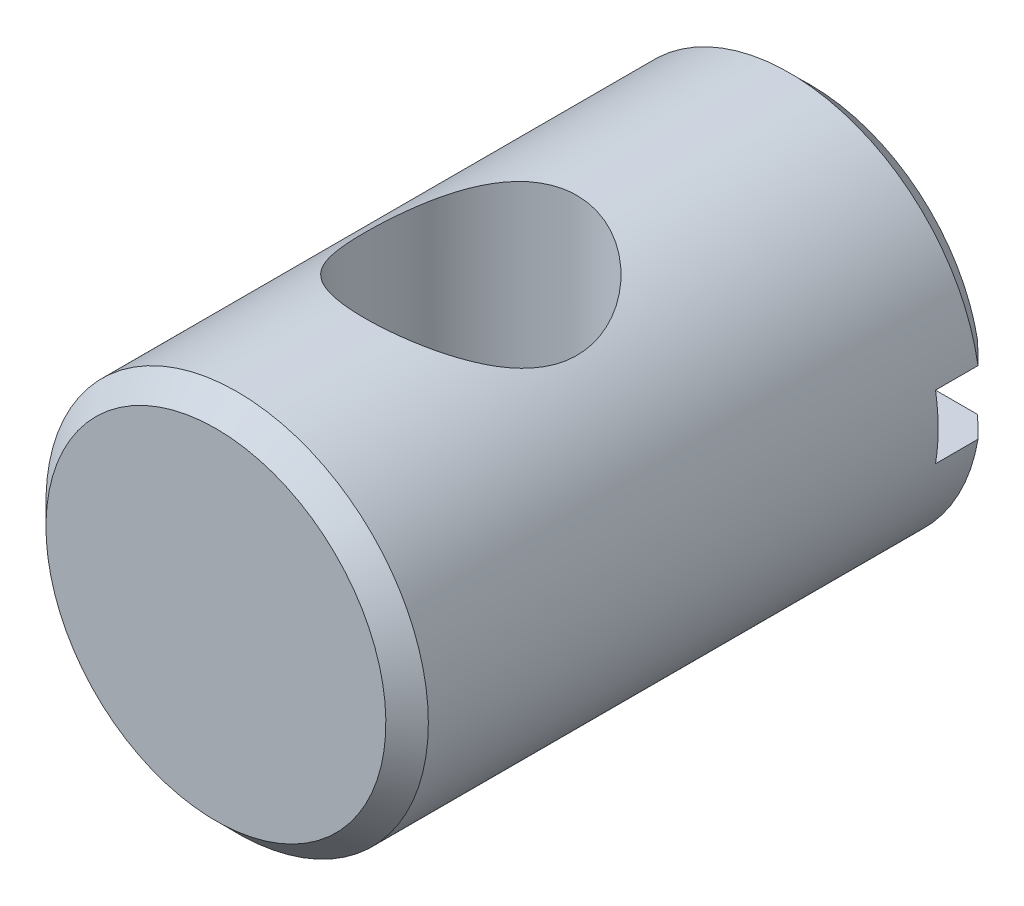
ISO-10303-21;
HEADER;
FILE_DESCRIPTION(('STEP AP214'),'2;1');
FILE_NAME('part.step','',(''),(''),'','','');
FILE_SCHEMA(('AUTOMOTIVE_DESIGN { 1 0 10303 214 1 1 1 1 }'));
ENDSEC;
DATA;
#1=APPLICATION_CONTEXT('core data for automotive mechanical design processes');
#2=APPLICATION_PROTOCOL_DEFINITION('international standard','automotive_design',2000,#1);
#3=PRODUCT_CONTEXT('',#1,'mechanical');
#4=PRODUCT('Part','Part','',(#3));
#5=PRODUCT_RELATED_PRODUCT_CATEGORY('part','',(#4));
#6=PRODUCT_DEFINITION_FORMATION('','',#4);
#7=PRODUCT_DEFINITION_CONTEXT('part definition',#1,'design');
#8=PRODUCT_DEFINITION('design','',#6,#7);
#9=PRODUCT_DEFINITION_SHAPE('','',#8);
#10=(LENGTH_UNIT() NAMED_UNIT(*) SI_UNIT(.MILLI.,.METRE.));
#11=(NAMED_UNIT(*) PLANE_ANGLE_UNIT() SI_UNIT($,.RADIAN.));
#12=(NAMED_UNIT(*) SI_UNIT($,.STERADIAN.) SOLID_ANGLE_UNIT());
#13=UNCERTAINTY_MEASURE_WITH_UNIT(LENGTH_MEASURE(1.E-05),#10,'distance_accuracy_value','');
#14=(GEOMETRIC_REPRESENTATION_CONTEXT(3) GLOBAL_UNCERTAINTY_ASSIGNED_CONTEXT((#13)) GLOBAL_UNIT_ASSIGNED_CONTEXT((#10,
#11,#12)) REPRESENTATION_CONTEXT('',''));
#15=CARTESIAN_POINT('',(0.,0.,0.));
#16=DIRECTION('',(0.,0.,1.));
#17=DIRECTION('',(1.,0.,0.));
#18=AXIS2_PLACEMENT_3D('',#15,#16,#17);
#19=CARTESIAN_POINT('',(-2.42861286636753E-13,0.,-6.49999999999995));
#20=DIRECTION('',(0.,0.,-1.));
#21=DIRECTION('',(-1.,0.,0.));
#22=AXIS2_PLACEMENT_3D('',#19,#20,#21);
#23=PLANE('',#22);
#24=DIRECTION('',(1.,0.,0.));
#25=VECTOR('',#24,1.);
#26=CARTESIAN_POINT('',(5.79284784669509,0.750000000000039,-6.49999999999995));
#27=LINE('',#26,#25);
#28=CARTESIAN_POINT('',(-4.43705983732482,0.750000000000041,-6.49999999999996));
#29=VERTEX_POINT('',#28);
#30=CARTESIAN_POINT('',(4.43705983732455,0.750000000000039,-6.49999999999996));
#31=VERTEX_POINT('',#30);
#32=EDGE_CURVE('E69',#29,#31,#27,.T.);
#33=ORIENTED_EDGE('',*,*,#32,.T.);
#34=CARTESIAN_POINT('',(-1.07087942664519E-13,1.60000569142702E-13,-6.49999999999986));
#35=DIRECTION('',(0.,0.,1.));
#36=DIRECTION('',(1.,0.,0.));
#37=AXIS2_PLACEMENT_3D('',#34,#35,#36);
#38=CIRCLE('',#37,4.5);
#39=CARTESIAN_POINT('',(4.43705983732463,-0.749999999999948,-6.49999999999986));
#40=VERTEX_POINT('',#39);
#41=EDGE_CURVE('E76',#31,#40,#38,.F.);
#42=ORIENTED_EDGE('',*,*,#41,.T.);
#43=DIRECTION('',(1.,0.,0.));
#44=VECTOR('',#43,1.);
#45=CARTESIAN_POINT('',(5.79284784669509,-0.749999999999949,-6.49999999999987));
#46=LINE('',#45,#44);
#47=CARTESIAN_POINT('',(-4.43705983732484,-0.749999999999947,-6.49999999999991));
#48=VERTEX_POINT('',#47);
#49=EDGE_CURVE('E72',#40,#48,#46,.F.);
#50=ORIENTED_EDGE('',*,*,#49,.T.);
#51=CARTESIAN_POINT('',(-1.07087942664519E-13,1.60000569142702E-13,-6.49999999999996));
#52=DIRECTION('',(0.,0.,1.));
#53=DIRECTION('',(1.,0.,0.));
#54=AXIS2_PLACEMENT_3D('',#51,#52,#53);
#55=CIRCLE('',#54,4.5);
#56=EDGE_CURVE('E20',#48,#29,#55,.F.);
#57=ORIENTED_EDGE('',*,*,#56,.T.);
#58=EDGE_LOOP('',(#33,#42,#50,#57));
#59=FACE_BOUND('',#58,.T.);
#60=ADVANCED_FACE('F17',(#59),#23,.T.);
#61=CARTESIAN_POINT('',(5.79284784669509,0.750000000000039,-6.49999999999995));
#62=DIRECTION('',(0.,1.,0.));
#63=DIRECTION('',(0.,0.,1.));
#64=AXIS2_PLACEMENT_3D('',#61,#62,#63);
#65=PLANE('',#64);
#66=CARTESIAN_POINT('',(-3.92905841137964,0.750000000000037,-7.99999999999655));
#67=CARTESIAN_POINT('',(-4.01380437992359,0.750000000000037,-7.91674699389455));
#68=CARTESIAN_POINT('',(-4.0985108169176,0.750000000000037,-7.83345382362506));
#69=CARTESIAN_POINT('',(-4.26784462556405,0.750000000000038,-7.66678715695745));
#70=CARTESIAN_POINT('',(-4.35247199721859,0.750000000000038,-7.58341366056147));
#71=CARTESIAN_POINT('',(-4.43705983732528,0.750000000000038,-7.50000000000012));
#72=B_SPLINE_CURVE_WITH_KNOTS('',3,(#66,#67,#68,#69,#70,#71),.UNSPECIFIED.,.F.,.F.,(4,2,4),(0.,
0.356393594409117,0.712787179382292),.UNSPECIFIED.);
#73=CARTESIAN_POINT('',(-3.92905841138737,0.750000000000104,-7.99999999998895));
#74=VERTEX_POINT('',#73);
#75=CARTESIAN_POINT('',(-4.43705983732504,0.750000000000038,-7.50000000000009));
#76=VERTEX_POINT('',#75);
#77=EDGE_CURVE('E85',#74,#76,#72,.T.);
#78=ORIENTED_EDGE('',*,*,#77,.F.);
#79=DIRECTION('',(1.,0.,0.));
#80=VECTOR('',#79,1.);
#81=CARTESIAN_POINT('',(-1.11022302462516E-13,0.750000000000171,-8.00000000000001));
#82=LINE('',#81,#80);
#83=CARTESIAN_POINT('',(3.92905841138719,0.750000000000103,-7.9999999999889));
#84=VERTEX_POINT('',#83);
#85=EDGE_CURVE('E259',#74,#84,#82,.T.);
#86=ORIENTED_EDGE('',*,*,#85,.T.);
#87=CARTESIAN_POINT('',(4.43705983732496,0.750000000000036,-7.50000000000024));
#88=CARTESIAN_POINT('',(4.3524719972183,0.750000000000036,-7.58341366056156));
#89=CARTESIAN_POINT('',(4.26784462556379,0.750000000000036,-7.66678715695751));
#90=CARTESIAN_POINT('',(4.0985108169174,0.750000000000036,-7.83345382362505));
#91=CARTESIAN_POINT('',(4.01380437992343,0.750000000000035,-7.91674699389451));
#92=CARTESIAN_POINT('',(3.92905841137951,0.750000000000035,-7.99999999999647));
#93=B_SPLINE_CURVE_WITH_KNOTS('',3,(#87,#88,#89,#90,#91,#92),.UNSPECIFIED.,.F.,.F.,(4,2,4),(0.,
0.356393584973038,0.712787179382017),.UNSPECIFIED.);
#94=CARTESIAN_POINT('',(4.43705983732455,0.750000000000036,-7.50000000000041));
#95=VERTEX_POINT('',#94);
#96=EDGE_CURVE('E91',#95,#84,#93,.T.);
#97=ORIENTED_EDGE('',*,*,#96,.F.);
#98=DIRECTION('',(0.,0.,1.));
#99=VECTOR('',#98,1.);
#100=CARTESIAN_POINT('',(4.43705983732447,0.750000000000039,-6.49999999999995));
#101=LINE('',#100,#99);
#102=EDGE_CURVE('E89',#31,#95,#101,.F.);
#103=ORIENTED_EDGE('',*,*,#102,.F.);
#104=ORIENTED_EDGE('',*,*,#32,.F.);
#105=DIRECTION('',(0.,0.,1.));
#106=VECTOR('',#105,1.);
#107=CARTESIAN_POINT('',(-4.43705983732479,0.750000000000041,-6.49999999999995));
#108=LINE('',#107,#106);
#109=EDGE_CURVE('E79',#76,#29,#108,.T.);
#110=ORIENTED_EDGE('',*,*,#109,.F.);
#111=EDGE_LOOP('',(#78,#86,#97,#103,#104,#110));
#112=FACE_BOUND('',#111,.T.);
#113=ADVANCED_FACE('F87',(#112),#65,.F.);
#114=CARTESIAN_POINT('',(5.79284784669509,-0.749999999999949,-6.49999999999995));
#115=DIRECTION('',(0.,-1.,0.));
#116=DIRECTION('',(0.,0.,-1.));
#117=AXIS2_PLACEMENT_3D('',#114,#115,#116);
#118=PLANE('',#117);
#119=CARTESIAN_POINT('',(3.92905841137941,-0.749999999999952,-7.99999999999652));
#120=CARTESIAN_POINT('',(4.01380437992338,-0.749999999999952,-7.9167469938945));
#121=CARTESIAN_POINT('',(4.0985108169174,-0.749999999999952,-7.833453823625));
#122=CARTESIAN_POINT('',(4.2678446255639,-0.749999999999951,-7.66678715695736));
#123=CARTESIAN_POINT('',(4.35247199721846,-0.749999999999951,-7.58341366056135));
#124=CARTESIAN_POINT('',(4.43705983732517,-0.749999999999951,-7.49999999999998));
#125=B_SPLINE_CURVE_WITH_KNOTS('',3,(#119,#120,#121,#122,#123,#124),.UNSPECIFIED.,.F.,.F.,(4,2,
4),(0.,0.356393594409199,0.712787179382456),.UNSPECIFIED.);
#126=CARTESIAN_POINT('',(3.92905841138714,-0.749999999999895,-7.99999999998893));
#127=VERTEX_POINT('',#126);
#128=CARTESIAN_POINT('',(4.43705983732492,-0.749999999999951,-7.50000000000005));
#129=VERTEX_POINT('',#128);
#130=EDGE_CURVE('E139',#127,#129,#125,.T.);
#131=ORIENTED_EDGE('',*,*,#130,.F.);
#132=DIRECTION('',(1.,0.,0.));
#133=VECTOR('',#132,1.);
#134=CARTESIAN_POINT('',(-1.11022302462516E-13,-0.749999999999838,-8.00000000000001));
#135=LINE('',#134,#133);
#136=CARTESIAN_POINT('',(-3.9290584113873,-0.749999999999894,-7.99999999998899));
#137=VERTEX_POINT('',#136);
#138=EDGE_CURVE('E138',#127,#137,#135,.F.);
#139=ORIENTED_EDGE('',*,*,#138,.T.);
#140=CARTESIAN_POINT('',(-4.4370598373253,-0.749999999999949,-7.50000000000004));
#141=CARTESIAN_POINT('',(-4.35247199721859,-0.74999999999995,-7.58341366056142));
#142=CARTESIAN_POINT('',(-4.26784462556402,-0.74999999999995,-7.66678715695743));
#143=CARTESIAN_POINT('',(-4.09851081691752,-0.74999999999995,-7.83345382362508));
#144=CARTESIAN_POINT('',(-4.01380437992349,-0.749999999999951,-7.91674699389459));
#145=CARTESIAN_POINT('',(-3.92905841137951,-0.749999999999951,-7.99999999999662));
#146=B_SPLINE_CURVE_WITH_KNOTS('',3,(#140,#141,#142,#143,#144,#145),.UNSPECIFIED.,.F.,.F.,(4,2,
4),(0.,0.35639358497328,0.712787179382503),.UNSPECIFIED.);
#147=CARTESIAN_POINT('',(-4.43705983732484,-0.749999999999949,-7.50000000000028));
#148=VERTEX_POINT('',#147);
#149=EDGE_CURVE('E35',#148,#137,#146,.T.);
#150=ORIENTED_EDGE('',*,*,#149,.F.);
#151=DIRECTION('',(0.,0.,-1.));
#152=VECTOR('',#151,1.);
#153=CARTESIAN_POINT('',(-4.43705983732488,-0.749999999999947,-6.49999999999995));
#154=LINE('',#153,#152);
#155=EDGE_CURVE('E263',#48,#148,#154,.T.);
#156=ORIENTED_EDGE('',*,*,#155,.F.);
#157=ORIENTED_EDGE('',*,*,#49,.F.);
#158=DIRECTION('',(0.,0.,-1.));
#159=VECTOR('',#158,1.);
#160=CARTESIAN_POINT('',(4.43705983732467,-0.749999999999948,-6.49999999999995));
#161=LINE('',#160,#159);
#162=EDGE_CURVE('E147',#129,#40,#161,.F.);
#163=ORIENTED_EDGE('',*,*,#162,.F.);
#164=EDGE_LOOP('',(#131,#139,#150,#156,#157,#163));
#165=FACE_BOUND('',#164,.T.);
#166=ADVANCED_FACE('F152',(#165),#118,.F.);
#167=CARTESIAN_POINT('',(-1.11022302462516E-13,1.56125112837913E-13,-8.00000000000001));
#168=DIRECTION('',(0.,0.,1.));
#169=DIRECTION('',(1.,0.,0.));
#170=AXIS2_PLACEMENT_3D('',#167,#168,#169);
#171=PLANE('',#170);
#172=ORIENTED_EDGE('',*,*,#85,.F.);
#173=CARTESIAN_POINT('',(-1.12323345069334E-13,1.79158385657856E-13,-7.99999999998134));
#174=DIRECTION('',(0.,0.,1.));
#175=DIRECTION('',(1.,0.,0.));
#176=AXIS2_PLACEMENT_3D('',#173,#174,#175);
#177=CIRCLE('',#176,4.00000000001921);
#178=EDGE_CURVE('E135',#84,#74,#177,.T.);
#179=ORIENTED_EDGE('',*,*,#178,.F.);
#180=EDGE_LOOP('',(#172,#179));
#181=FACE_BOUND('',#180,.T.);
#182=ADVANCED_FACE('F184',(#181),#171,.F.);
#183=CARTESIAN_POINT('',(-1.11022302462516E-13,1.56125112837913E-13,-8.00000000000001));
#184=DIRECTION('',(0.,0.,1.));
#185=DIRECTION('',(1.,0.,0.));
#186=AXIS2_PLACEMENT_3D('',#183,#184,#185);
#187=PLANE('',#186);
#188=ORIENTED_EDGE('',*,*,#138,.F.);
#189=CARTESIAN_POINT('',(-1.12323345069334E-13,1.79158385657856E-13,-7.99999999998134));
#190=DIRECTION('',(0.,0.,1.));
#191=DIRECTION('',(1.,0.,0.));
#192=AXIS2_PLACEMENT_3D('',#189,#190,#191);
#193=CIRCLE('',#192,4.00000000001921);
#194=EDGE_CURVE('E131',#137,#127,#193,.T.);
#195=ORIENTED_EDGE('',*,*,#194,.F.);
#196=EDGE_LOOP('',(#188,#195));
#197=FACE_BOUND('',#196,.T.);
#198=ADVANCED_FACE('F167',(#197),#187,.F.);
#199=CARTESIAN_POINT('',(-1.11022302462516E-13,1.80411241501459E-13,-7.50000000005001));
#200=DIRECTION('',(0.,0.,1.));
#201=DIRECTION('',(1.,0.,0.));
#202=AXIS2_PLACEMENT_3D('',#199,#200,#201);
#203=CONICAL_SURFACE('',#202,4.49999999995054,0.785398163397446);
#204=ORIENTED_EDGE('',*,*,#96,.T.);
#205=ORIENTED_EDGE('',*,*,#178,.T.);
#206=ORIENTED_EDGE('',*,*,#77,.T.);
#207=CARTESIAN_POINT('',(-1.09710849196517E-13,1.57416931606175E-13,-7.50000000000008));
#208=DIRECTION('',(0.,0.,1.));
#209=DIRECTION('',(1.,0.,0.));
#210=AXIS2_PLACEMENT_3D('',#207,#208,#209);
#211=CIRCLE('',#210,4.5);
#212=EDGE_CURVE('E83',#95,#76,#211,.T.);
#213=ORIENTED_EDGE('',*,*,#212,.F.);
#214=EDGE_LOOP('',(#204,#205,#206,#213));
#215=FACE_BOUND('',#214,.T.);
#216=ADVANCED_FACE('F162',(#215),#203,.T.);
#217=CARTESIAN_POINT('',(-1.66533453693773E-13,2.1163626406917E-13,5.99999999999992));
#218=DIRECTION('',(0.,0.,1.));
#219=DIRECTION('',(1.,0.,0.));
#220=AXIS2_PLACEMENT_3D('',#217,#218,#219);
#221=PLANE('',#220);
#222=CARTESIAN_POINT('',(-1.66581640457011E-13,2.11693674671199E-13,6.00000000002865));
#223=DIRECTION('',(0.,0.,-1.));
#224=DIRECTION('',(0.,1.,0.));
#225=AXIS2_PLACEMENT_3D('',#222,#223,#224);
#226=CIRCLE('',#225,3.99999999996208);
#227=CARTESIAN_POINT('',(-1.66581640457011E-13,3.99999999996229,6.00000000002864));
#228=VERTEX_POINT('',#227);
#229=EDGE_CURVE('E125',#228,#228,#226,.T.);
#230=ORIENTED_EDGE('',*,*,#229,.F.);
#231=EDGE_LOOP('',(#230));
#232=FACE_BOUND('',#231,.T.);
#233=ADVANCED_FACE('F158',(#232),#221,.T.);
#234=CARTESIAN_POINT('',(-1.11022302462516E-13,1.80411241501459E-13,-7.50000000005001));
#235=DIRECTION('',(0.,0.,1.));
#236=DIRECTION('',(1.,0.,0.));
#237=AXIS2_PLACEMENT_3D('',#234,#235,#236);
#238=CONICAL_SURFACE('',#237,4.49999999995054,0.785398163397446);
#239=ORIENTED_EDGE('',*,*,#149,.T.);
#240=ORIENTED_EDGE('',*,*,#194,.T.);
#241=ORIENTED_EDGE('',*,*,#130,.T.);
#242=CARTESIAN_POINT('',(-1.09710849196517E-13,1.57416931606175E-13,-7.5000000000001));
#243=DIRECTION('',(0.,0.,1.));
#244=DIRECTION('',(1.,0.,0.));
#245=AXIS2_PLACEMENT_3D('',#242,#243,#244);
#246=CIRCLE('',#245,4.5);
#247=EDGE_CURVE('E124',#148,#129,#246,.T.);
#248=ORIENTED_EDGE('',*,*,#247,.F.);
#249=EDGE_LOOP('',(#239,#240,#241,#248));
#250=FACE_BOUND('',#249,.T.);
#251=ADVANCED_FACE('F117',(#250),#238,.T.);
#252=CARTESIAN_POINT('',(-1.67834496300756E-13,2.10344445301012E-13,5.50000000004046));
#253=DIRECTION('',(0.,0.,-1.));
#254=DIRECTION('',(0.,1.,0.));
#255=AXIS2_PLACEMENT_3D('',#252,#253,#254);
#256=CONICAL_SURFACE('',#255,4.49999999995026,0.785398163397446);
#257=CARTESIAN_POINT('',(0.,1.91004219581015E-13,5.5));
#258=DIRECTION('',(0.,0.,1.));
#259=DIRECTION('',(1.,0.,0.));
#260=AXIS2_PLACEMENT_3D('',#257,#258,#259);
#261=CIRCLE('',#260,4.5);
#262=CARTESIAN_POINT('',(4.49999999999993,1.91004219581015E-13,5.49999999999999));
#263=VERTEX_POINT('',#262);
#264=EDGE_CURVE('E26',#263,#263,#261,.F.);
#265=ORIENTED_EDGE('',*,*,#264,.F.);
#266=EDGE_LOOP('',(#265));
#267=FACE_BOUND('',#266,.T.);
#268=ORIENTED_EDGE('',*,*,#229,.T.);
#269=EDGE_LOOP('',(#268));
#270=FACE_BOUND('',#269,.T.);
#271=ADVANCED_FACE('F112',(#267,#270),#256,.T.);
#272=CARTESIAN_POINT('',(0.,4.50000000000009,0.));
#273=DIRECTION('',(0.,1.,0.));
#274=DIRECTION('',(0.,0.,1.));
#275=AXIS2_PLACEMENT_3D('',#272,#273,#274);
#276=CYLINDRICAL_SURFACE('',#275,2.49999999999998);
#277=CARTESIAN_POINT('',(0.,-4.49999999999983,-2.50000000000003));
#278=CARTESIAN_POINT('',(-0.129752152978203,-4.50000234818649,-2.50000277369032));
#279=CARTESIAN_POINT('',(-0.259488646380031,-4.49433973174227,-2.48985362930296));
#280=CARTESIAN_POINT('',(-0.514931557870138,-4.4722802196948,-2.44980965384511));
#281=CARTESIAN_POINT('',(-0.640637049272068,-4.45588087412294,-2.419910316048));
#282=CARTESIAN_POINT('',(-0.884087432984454,-4.41402415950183,-2.34193967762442));
#283=CARTESIAN_POINT('',(-1.00185985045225,-4.38860025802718,-2.29393547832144));
#284=CARTESIAN_POINT('',(-1.2274603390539,-4.33092561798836,-2.18156801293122));
#285=CARTESIAN_POINT('',(-1.33528606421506,-4.2986732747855,-2.11720090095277));
#286=CARTESIAN_POINT('',(-1.54633614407,-4.22753980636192,-1.96891330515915));
#287=CARTESIAN_POINT('',(-1.648719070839,-4.18835367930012,-1.88394433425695));
#288=CARTESIAN_POINT('',(-1.83858804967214,-4.10855472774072,-1.69916731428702));
#289=CARTESIAN_POINT('',(-1.92605889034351,-4.06794049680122,-1.59934430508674));
#290=CARTESIAN_POINT('',(-2.09257062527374,-3.98505246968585,-1.37568480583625));
#291=CARTESIAN_POINT('',(-2.16985879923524,-3.94302762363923,-1.25043993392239));
#292=CARTESIAN_POINT('',(-2.30193681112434,-3.86741691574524,-0.986308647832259));
#293=CARTESIAN_POINT('',(-2.35675885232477,-3.83381900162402,-0.847442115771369));
#294=CARTESIAN_POINT('',(-2.43228219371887,-3.7862330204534,-0.589942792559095));
#295=CARTESIAN_POINT('',(-2.45773277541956,-3.76960777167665,-0.473190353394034));
#296=CARTESIAN_POINT('',(-2.49167870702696,-3.74726165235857,-0.236264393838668));
#297=CARTESIAN_POINT('',(-2.50019076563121,-3.74153003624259,-0.116094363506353));
#298=CARTESIAN_POINT('',(-2.49980245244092,-3.74178926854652,0.124331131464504));
#299=CARTESIAN_POINT('',(-2.49088301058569,-3.74779295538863,0.24458654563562));
#300=CARTESIAN_POINT('',(-2.45610446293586,-3.77067197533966,0.481578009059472));
#301=CARTESIAN_POINT('',(-2.43023435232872,-3.78755437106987,0.598311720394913));
#302=CARTESIAN_POINT('',(-2.36277648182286,-3.82999425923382,0.825432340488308));
#303=CARTESIAN_POINT('',(-2.32118520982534,-3.85555368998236,0.935817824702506));
#304=CARTESIAN_POINT('',(-2.22370246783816,-3.91258611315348,1.14840769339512));
#305=CARTESIAN_POINT('',(-2.16780543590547,-3.94406140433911,1.25060887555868));
#306=CARTESIAN_POINT('',(-2.03346523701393,-4.01517451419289,1.46041196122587));
#307=CARTESIAN_POINT('',(-1.95288676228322,-4.05532589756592,1.56647471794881));
#308=CARTESIAN_POINT('',(-1.77597038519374,-4.13586598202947,1.76453479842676));
#309=CARTESIAN_POINT('',(-1.67961967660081,-4.17625485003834,1.85652057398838));
#310=CARTESIAN_POINT('',(-1.46212999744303,-4.25757767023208,2.03315666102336));
#311=CARTESIAN_POINT('',(-1.33946785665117,-4.29815115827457,2.11611580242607));
#312=CARTESIAN_POINT('',(-1.07945230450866,-4.37069105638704,2.25982127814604));
#313=CARTESIAN_POINT('',(-0.942111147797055,-4.40266456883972,2.32058595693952));
#314=CARTESIAN_POINT('',(-0.672038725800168,-4.4514171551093,2.41172680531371));
#315=CARTESIAN_POINT('',(-0.540407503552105,-4.4694629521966,2.44467338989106));
#316=CARTESIAN_POINT('',(-0.272509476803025,-4.49374886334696,2.48880064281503));
#317=CARTESIAN_POINT('',(-0.136246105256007,-4.49999753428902,2.4999970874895));
#318=CARTESIAN_POINT('',(0.129752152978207,-4.50000234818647,2.50000277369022));
#319=CARTESIAN_POINT('',(0.259488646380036,-4.49433973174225,2.48985362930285));
#320=CARTESIAN_POINT('',(0.514931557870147,-4.47228021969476,2.44980965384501));
#321=CARTESIAN_POINT('',(0.640637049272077,-4.4558808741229,2.41991031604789));
#322=CARTESIAN_POINT('',(0.884087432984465,-4.41402415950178,2.34193967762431));
#323=CARTESIAN_POINT('',(1.00185985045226,-4.38860025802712,2.29393547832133));
#324=CARTESIAN_POINT('',(1.22746033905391,-4.33092561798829,2.18156801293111));
#325=CARTESIAN_POINT('',(1.33528606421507,-4.29867327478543,2.11720090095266));
#326=CARTESIAN_POINT('',(1.54633614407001,-4.22753980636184,1.96891330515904));
#327=CARTESIAN_POINT('',(1.64871907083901,-4.18835367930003,1.88394433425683));
#328=CARTESIAN_POINT('',(1.83858804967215,-4.10855472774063,1.6991673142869));
#329=CARTESIAN_POINT('',(1.92605889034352,-4.06794049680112,1.59934430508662));
#330=CARTESIAN_POINT('',(2.09257062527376,-3.98505246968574,1.37568480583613));
#331=CARTESIAN_POINT('',(2.16985879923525,-3.94302762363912,1.25043993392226));
#332=CARTESIAN_POINT('',(2.30193681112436,-3.86741691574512,0.986308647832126));
#333=CARTESIAN_POINT('',(2.35675885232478,-3.8338190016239,0.847442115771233));
#334=CARTESIAN_POINT('',(2.43228219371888,-3.78623302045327,0.58994279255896));
#335=CARTESIAN_POINT('',(2.45773277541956,-3.76960777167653,0.473190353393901));
#336=CARTESIAN_POINT('',(2.49167870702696,-3.74726165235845,0.236264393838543));
#337=CARTESIAN_POINT('',(2.50019076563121,-3.74153003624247,0.116094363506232));
#338=CARTESIAN_POINT('',(2.49980245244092,-3.7417892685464,-0.124331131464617));
#339=CARTESIAN_POINT('',(2.49088301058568,-3.74779295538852,-0.244586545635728));
#340=CARTESIAN_POINT('',(2.45610446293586,-3.77067197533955,-0.481578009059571));
#341=CARTESIAN_POINT('',(2.43023435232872,-3.78755437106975,-0.598311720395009));
#342=CARTESIAN_POINT('',(2.36277648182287,-3.82999425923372,-0.825432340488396));
#343=CARTESIAN_POINT('',(2.32118520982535,-3.85555368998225,-0.935817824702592));
#344=CARTESIAN_POINT('',(2.22370246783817,-3.91258611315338,-1.1484076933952));
#345=CARTESIAN_POINT('',(2.16780543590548,-3.94406140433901,-1.25060887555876));
#346=CARTESIAN_POINT('',(2.03346523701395,-4.0151745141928,-1.46041196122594));
#347=CARTESIAN_POINT('',(1.95288676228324,-4.05532589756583,-1.56647471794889));
#348=CARTESIAN_POINT('',(1.77597038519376,-4.13586598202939,-1.76453479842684));
#349=CARTESIAN_POINT('',(1.67961967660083,-4.17625485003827,-1.85652057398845));
#350=CARTESIAN_POINT('',(1.46212999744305,-4.25757767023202,-2.03315666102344));
#351=CARTESIAN_POINT('',(1.3394678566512,-4.29815115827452,-2.11611580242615));
#352=CARTESIAN_POINT('',(1.07945230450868,-4.370691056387,-2.25982127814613));
#353=CARTESIAN_POINT('',(0.942111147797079,-4.40266456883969,-2.32058595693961));
#354=CARTESIAN_POINT('',(0.672038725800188,-4.45141715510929,-2.4117268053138));
#355=CARTESIAN_POINT('',(0.540407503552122,-4.46946295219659,-2.44467338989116));
#356=CARTESIAN_POINT('',(0.272509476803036,-4.49374886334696,-2.48880064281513));
#357=CARTESIAN_POINT('',(0.136246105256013,-4.49999753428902,-2.4999970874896));
#358=CARTESIAN_POINT('',(0.,-4.49999999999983,-2.50000000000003));
#359=B_SPLINE_CURVE_WITH_KNOTS('',3,(#277,#278,#279,#280,#281,#282,#283,#284,#285,#286,#287,
#288,#289,#290,#291,#292,#293,#294,#295,#296,#297,#298,#299,#300,#301,#302,#303,#304,#305,#306,
#307,#308,#309,#310,#311,#312,#313,#314,#315,#316,#317,#318,#319,#320,#321,#322,#323,#324,#325,
#326,#327,#328,#329,#330,#331,#332,#333,#334,#335,#336,#337,#338,#339,#340,#341,#342,#343,#344,
#345,#346,#347,#348,#349,#350,#351,#352,#353,#354,#355,#356,#357,#358),.UNSPECIFIED.,.T.,.F.,(4,
2,2,2,2,2,2,2,2,2,2,2,2,2,2,2,2,2,2,2,2,2,2,2,2,2,2,2,2,2,2,2,2,2,2,2,2,2,2,2,4),(0.,
0.388727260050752,0.777543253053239,1.16493213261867,1.55241214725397,1.96683799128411,
2.3816840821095,2.83857260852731,3.2948039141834,3.6551617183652,4.01516387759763,
4.37556009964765,4.73619053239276,5.09690157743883,5.4577530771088,5.8734371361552,
6.28946039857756,6.74769338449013,7.20554676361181,7.61402579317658,8.0222084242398,
8.41093568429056,8.79975167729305,9.18714055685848,9.57462057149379,9.98904641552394,
10.4038925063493,10.8607810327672,11.3170123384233,11.677370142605,12.0373723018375,
12.3977685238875,12.7583989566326,13.1191100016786,13.4799615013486,13.895645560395,
14.3116688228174,14.7699018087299,15.2277551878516,15.6362342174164,16.0444168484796),.UNSPECIFIED.);
#360=CARTESIAN_POINT('',(0.,-4.49999999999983,-2.50000000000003));
#361=VERTEX_POINT('',#360);
#362=EDGE_CURVE('E11',#361,#361,#359,.T.);
#363=ORIENTED_EDGE('',*,*,#362,.F.);
#364=EDGE_LOOP('',(#363));
#365=FACE_BOUND('',#364,.T.);
#366=CARTESIAN_POINT('',(0.,4.50000000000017,-2.50000000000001));
#367=CARTESIAN_POINT('',(0.129752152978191,4.50000234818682,-2.5000027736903));
#368=CARTESIAN_POINT('',(0.25948864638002,4.4943397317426,-2.48985362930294));
#369=CARTESIAN_POINT('',(0.514931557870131,4.47228021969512,-2.44980965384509));
#370=CARTESIAN_POINT('',(0.640637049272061,4.45588087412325,-2.41991031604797));
#371=CARTESIAN_POINT('',(0.884087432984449,4.41402415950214,-2.3419396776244));
#372=CARTESIAN_POINT('',(1.00185985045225,4.38860025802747,-2.29393547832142));
#373=CARTESIAN_POINT('',(1.2274603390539,4.33092561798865,-2.1815680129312));
#374=CARTESIAN_POINT('',(1.33528606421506,4.29867327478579,-2.11720090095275));
#375=CARTESIAN_POINT('',(1.54633614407,4.22753980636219,-1.96891330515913));
#376=CARTESIAN_POINT('',(1.648719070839,4.18835367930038,-1.88394433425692));
#377=CARTESIAN_POINT('',(1.83858804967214,4.10855472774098,-1.69916731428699));
#378=CARTESIAN_POINT('',(1.92605889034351,4.06794049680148,-1.59934430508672));
#379=CARTESIAN_POINT('',(2.09257062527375,3.98505246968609,-1.37568480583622));
#380=CARTESIAN_POINT('',(2.16985879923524,3.94302762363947,-1.25043993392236));
#381=CARTESIAN_POINT('',(2.30193681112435,3.86741691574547,-0.986308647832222));
#382=CARTESIAN_POINT('',(2.35675885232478,3.83381900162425,-0.84744211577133));
#383=CARTESIAN_POINT('',(2.43228219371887,3.78623302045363,-0.589942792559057));
#384=CARTESIAN_POINT('',(2.45773277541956,3.76960777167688,-0.473190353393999));
#385=CARTESIAN_POINT('',(2.49167870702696,3.7472616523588,-0.236264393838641));
#386=CARTESIAN_POINT('',(2.50019076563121,3.74153003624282,-0.11609436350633));
#387=CARTESIAN_POINT('',(2.49980245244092,3.74178926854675,0.12433113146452));
#388=CARTESIAN_POINT('',(2.49088301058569,3.74779295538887,0.244586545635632));
#389=CARTESIAN_POINT('',(2.45610446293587,3.77067197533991,0.481578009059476));
#390=CARTESIAN_POINT('',(2.43023435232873,3.78755437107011,0.598311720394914));
#391=CARTESIAN_POINT('',(2.36277648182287,3.82999425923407,0.825432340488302));
#392=CARTESIAN_POINT('',(2.32118520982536,3.8555536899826,0.935817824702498));
#393=CARTESIAN_POINT('',(2.22370246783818,3.91258611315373,1.1484076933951));
#394=CARTESIAN_POINT('',(2.16780543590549,3.94406140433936,1.25060887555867));
#395=CARTESIAN_POINT('',(2.03346523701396,4.01517451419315,1.46041196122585));
#396=CARTESIAN_POINT('',(1.95288676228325,4.05532589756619,1.56647471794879));
#397=CARTESIAN_POINT('',(1.77597038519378,4.13586598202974,1.76453479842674));
#398=CARTESIAN_POINT('',(1.67961967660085,4.17625485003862,1.85652057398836));
#399=CARTESIAN_POINT('',(1.46212999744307,4.25757767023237,2.03315666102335));
#400=CARTESIAN_POINT('',(1.33946785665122,4.29815115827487,2.11611580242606));
#401=CARTESIAN_POINT('',(1.0794523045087,4.37069105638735,2.25982127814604));
#402=CARTESIAN_POINT('',(0.942111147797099,4.40266456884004,2.32058595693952));
#403=CARTESIAN_POINT('',(0.672038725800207,4.45141715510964,2.41172680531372));
#404=CARTESIAN_POINT('',(0.540407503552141,4.46946295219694,2.44467338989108));
#405=CARTESIAN_POINT('',(0.272509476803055,4.49374886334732,2.48880064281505));
#406=CARTESIAN_POINT('',(0.136246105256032,4.49999753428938,2.49999708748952));
#407=CARTESIAN_POINT('',(-0.129752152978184,4.50000234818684,2.50000277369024));
#408=CARTESIAN_POINT('',(-0.259488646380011,4.49433973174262,2.48985362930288));
#409=CARTESIAN_POINT('',(-0.514931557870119,4.47228021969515,2.44980965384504));
#410=CARTESIAN_POINT('',(-0.640637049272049,4.4558808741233,2.41991031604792));
#411=CARTESIAN_POINT('',(-0.884087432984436,4.41402415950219,2.34193967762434));
#412=CARTESIAN_POINT('',(-1.00185985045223,4.38860025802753,2.29393547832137));
#413=CARTESIAN_POINT('',(-1.22746033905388,4.33092561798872,2.18156801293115));
#414=CARTESIAN_POINT('',(-1.33528606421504,4.29867327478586,2.1172009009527));
#415=CARTESIAN_POINT('',(-1.54633614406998,4.22753980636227,1.96891330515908));
#416=CARTESIAN_POINT('',(-1.64871907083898,4.18835367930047,1.88394433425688));
#417=CARTESIAN_POINT('',(-1.83858804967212,4.10855472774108,1.69916731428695));
#418=CARTESIAN_POINT('',(-1.92605889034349,4.06794049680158,1.59934430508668));
#419=CARTESIAN_POINT('',(-2.09257062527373,3.98505246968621,1.37568480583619));
#420=CARTESIAN_POINT('',(-2.16985879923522,3.94302762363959,1.25043993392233));
#421=CARTESIAN_POINT('',(-2.30193681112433,3.86741691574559,0.986308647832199));
#422=CARTESIAN_POINT('',(-2.35675885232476,3.83381900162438,0.84744211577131));
#423=CARTESIAN_POINT('',(-2.43228219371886,3.78623302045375,0.589942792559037));
#424=CARTESIAN_POINT('',(-2.45773277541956,3.769607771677,0.473190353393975));
#425=CARTESIAN_POINT('',(-2.49167870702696,3.74726165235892,0.23626439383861));
#426=CARTESIAN_POINT('',(-2.50019076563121,3.74153003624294,0.116094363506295));
#427=CARTESIAN_POINT('',(-2.49980245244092,3.74178926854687,-0.124331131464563));
#428=CARTESIAN_POINT('',(-2.49088301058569,3.74779295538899,-0.244586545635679));
#429=CARTESIAN_POINT('',(-2.45610446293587,3.77067197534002,-0.481578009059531));
#430=CARTESIAN_POINT('',(-2.43023435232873,3.78755437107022,-0.598311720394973));
#431=CARTESIAN_POINT('',(-2.36277648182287,3.82999425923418,-0.825432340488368));
#432=CARTESIAN_POINT('',(-2.32118520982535,3.85555368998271,-0.935817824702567));
#433=CARTESIAN_POINT('',(-2.22370246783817,3.91258611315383,-1.14840769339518));
#434=CARTESIAN_POINT('',(-2.16780543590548,3.94406140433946,-1.25060887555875));
#435=CARTESIAN_POINT('',(-2.03346523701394,4.01517451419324,-1.46041196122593));
#436=CARTESIAN_POINT('',(-1.95288676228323,4.05532589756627,-1.56647471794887));
#437=CARTESIAN_POINT('',(-1.77597038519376,4.13586598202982,-1.76453479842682));
#438=CARTESIAN_POINT('',(-1.67961967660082,4.17625485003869,-1.85652057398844));
#439=CARTESIAN_POINT('',(-1.46212999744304,4.25757767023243,-2.03315666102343));
#440=CARTESIAN_POINT('',(-1.33946785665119,4.29815115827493,-2.11611580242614));
#441=CARTESIAN_POINT('',(-1.07945230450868,4.37069105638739,-2.25982127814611));
#442=CARTESIAN_POINT('',(-0.942111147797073,4.40266456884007,-2.32058595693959));
#443=CARTESIAN_POINT('',(-0.672038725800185,4.45141715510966,-2.41172680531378));
#444=CARTESIAN_POINT('',(-0.540407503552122,4.46946295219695,-2.44467338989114));
#445=CARTESIAN_POINT('',(-0.272509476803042,4.49374886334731,-2.4888006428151));
#446=CARTESIAN_POINT('',(-0.136246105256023,4.49999753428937,-2.49999708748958));
#447=CARTESIAN_POINT('',(0.,4.50000000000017,-2.50000000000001));
#448=B_SPLINE_CURVE_WITH_KNOTS('',3,(#366,#367,#368,#369,#370,#371,#372,#373,#374,#375,#376,
#377,#378,#379,#380,#381,#382,#383,#384,#385,#386,#387,#388,#389,#390,#391,#392,#393,#394,#395,
#396,#397,#398,#399,#400,#401,#402,#403,#404,#405,#406,#407,#408,#409,#410,#411,#412,#413,#414,
#415,#416,#417,#418,#419,#420,#421,#422,#423,#424,#425,#426,#427,#428,#429,#430,#431,#432,#433,
#434,#435,#436,#437,#438,#439,#440,#441,#442,#443,#444,#445,#446,#447),.UNSPECIFIED.,.T.,.F.,(4,
2,2,2,2,2,2,2,2,2,2,2,2,2,2,2,2,2,2,2,2,2,2,2,2,2,2,2,2,2,2,2,2,2,2,2,2,2,2,2,4),(0.,
0.388727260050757,0.777543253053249,1.16493213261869,1.55241214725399,1.96683799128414,
2.38168408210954,2.83857260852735,3.29480391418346,3.65516171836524,4.01516387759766,
4.37556009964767,4.73619053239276,5.09690157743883,5.45775307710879,5.87343713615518,
6.28946039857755,6.74769338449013,7.20554676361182,7.6140257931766,8.02220842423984,
8.41093568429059,8.79975167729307,9.18714055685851,9.5746205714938,9.98904641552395,
10.4038925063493,10.8607810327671,11.3170123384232,11.677370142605,12.0373723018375,
12.3977685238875,12.7583989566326,13.1191100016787,13.4799615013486,13.895645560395,
14.3116688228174,14.76990180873,15.2277551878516,15.6362342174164,16.0444168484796),.UNSPECIFIED.);
#449=CARTESIAN_POINT('',(0.,4.50000000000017,-2.50000000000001));
#450=VERTEX_POINT('',#449);
#451=EDGE_CURVE('E98',#450,#450,#448,.T.);
#452=ORIENTED_EDGE('',*,*,#451,.F.);
#453=EDGE_LOOP('',(#452));
#454=FACE_BOUND('',#453,.T.);
#455=ADVANCED_FACE('F102',(#365,#454),#276,.F.);
#456=CARTESIAN_POINT('',(-1.11022302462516E-13,1.56125112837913E-13,-8.00000000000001));
#457=DIRECTION('',(0.,0.,1.));
#458=DIRECTION('',(1.,0.,0.));
#459=AXIS2_PLACEMENT_3D('',#456,#457,#458);
#460=CYLINDRICAL_SURFACE('',#459,4.5);
#461=ORIENTED_EDGE('',*,*,#56,.F.);
#462=ORIENTED_EDGE('',*,*,#155,.T.);
#463=ORIENTED_EDGE('',*,*,#247,.T.);
#464=ORIENTED_EDGE('',*,*,#162,.T.);
#465=ORIENTED_EDGE('',*,*,#41,.F.);
#466=ORIENTED_EDGE('',*,*,#102,.T.);
#467=ORIENTED_EDGE('',*,*,#212,.T.);
#468=ORIENTED_EDGE('',*,*,#109,.T.);
#469=EDGE_LOOP('',(#461,#462,#463,#464,#465,#466,#467,#468));
#470=FACE_BOUND('',#469,.T.);
#471=ORIENTED_EDGE('',*,*,#362,.T.);
#472=EDGE_LOOP('',(#471));
#473=FACE_BOUND('',#472,.T.);
#474=ORIENTED_EDGE('',*,*,#264,.T.);
#475=EDGE_LOOP('',(#474));
#476=FACE_BOUND('',#475,.T.);
#477=ORIENTED_EDGE('',*,*,#451,.T.);
#478=EDGE_LOOP('',(#477));
#479=FACE_BOUND('',#478,.T.);
#480=ADVANCED_FACE('F80',(#470,#473,#476,#479),#460,.T.);
#481=CLOSED_SHELL('',(#60,#113,#166,#182,#198,#216,#233,#251,#271,#455,#480));
#482=MANIFOLD_SOLID_BREP('B1',#481);
#483=ADVANCED_BREP_SHAPE_REPRESENTATION('',(#18,#482),#14);
#484=SHAPE_DEFINITION_REPRESENTATION(#9,#483);
ENDSEC;
END-ISO-10303-21;
